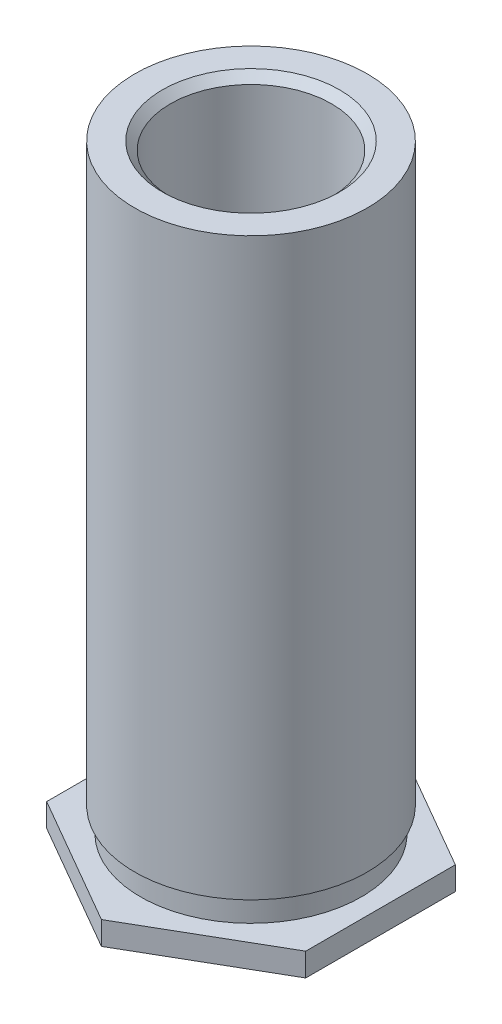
ISO-10303-21;
HEADER;
FILE_DESCRIPTION(('STEP AP214'),'2;1');
FILE_NAME('part.step','',(''),(''),'','','');
FILE_SCHEMA(('AUTOMOTIVE_DESIGN { 1 0 10303 214 1 1 1 1 }'));
ENDSEC;
DATA;
#1=APPLICATION_CONTEXT('core data for automotive mechanical design processes');
#2=APPLICATION_PROTOCOL_DEFINITION('international standard','automotive_design',2000,#1);
#3=PRODUCT_CONTEXT('',#1,'mechanical');
#4=PRODUCT('Part','Part','',(#3));
#5=PRODUCT_RELATED_PRODUCT_CATEGORY('part','',(#4));
#6=PRODUCT_DEFINITION_FORMATION('','',#4);
#7=PRODUCT_DEFINITION_CONTEXT('part definition',#1,'design');
#8=PRODUCT_DEFINITION('design','',#6,#7);
#9=PRODUCT_DEFINITION_SHAPE('','',#8);
#10=(LENGTH_UNIT() NAMED_UNIT(*) SI_UNIT(.MILLI.,.METRE.));
#11=(NAMED_UNIT(*) PLANE_ANGLE_UNIT() SI_UNIT($,.RADIAN.));
#12=(NAMED_UNIT(*) SI_UNIT($,.STERADIAN.) SOLID_ANGLE_UNIT());
#13=UNCERTAINTY_MEASURE_WITH_UNIT(LENGTH_MEASURE(1.E-05),#10,'distance_accuracy_value','');
#14=(GEOMETRIC_REPRESENTATION_CONTEXT(3) GLOBAL_UNCERTAINTY_ASSIGNED_CONTEXT((#13)) GLOBAL_UNIT_ASSIGNED_CONTEXT((#10,
#11,#12)) REPRESENTATION_CONTEXT('',''));
#15=CARTESIAN_POINT('',(0.,0.,0.));
#16=DIRECTION('',(0.,0.,1.));
#17=DIRECTION('',(1.,0.,0.));
#18=AXIS2_PLACEMENT_3D('',#15,#16,#17);
#19=CARTESIAN_POINT('',(4.596384,0.7112,0.));
#20=DIRECTION('',(0.,1.,0.));
#21=DIRECTION('',(0.,0.,1.));
#22=AXIS2_PLACEMENT_3D('',#19,#20,#21);
#23=PLANE('',#22);
#24=CARTESIAN_POINT('',(0.,0.711199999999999,0.));
#25=DIRECTION('',(0.,-1.,0.));
#26=DIRECTION('',(0.,0.,-1.));
#27=AXIS2_PLACEMENT_3D('',#24,#25,#26);
#28=CIRCLE('',#27,3.3782);
#29=CARTESIAN_POINT('',(0.,0.711199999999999,-3.3782));
#30=VERTEX_POINT('',#29);
#31=EDGE_CURVE('E143',#30,#30,#28,.T.);
#32=ORIENTED_EDGE('',*,*,#31,.T.);
#33=EDGE_LOOP('',(#32));
#34=FACE_BOUND('',#33,.T.);
#35=DIRECTION('',(0.866025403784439,0.,0.5));
#36=VECTOR('',#35,1.);
#37=CARTESIAN_POINT('',(0.,0.7112,4.57538541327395));
#38=LINE('',#37,#36);
#39=CARTESIAN_POINT('',(-3.9624,0.7112,2.28769270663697));
#40=VERTEX_POINT('',#39);
#41=CARTESIAN_POINT('',(0.,0.7112,4.57538541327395));
#42=VERTEX_POINT('',#41);
#43=EDGE_CURVE('E127',#40,#42,#38,.T.);
#44=ORIENTED_EDGE('',*,*,#43,.T.);
#45=DIRECTION('',(0.866025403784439,0.,-0.5));
#46=VECTOR('',#45,1.);
#47=CARTESIAN_POINT('',(3.9624,0.7112,2.28769270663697));
#48=LINE('',#47,#46);
#49=CARTESIAN_POINT('',(3.9624,0.7112,2.28769270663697));
#50=VERTEX_POINT('',#49);
#51=EDGE_CURVE('E116',#42,#50,#48,.T.);
#52=ORIENTED_EDGE('',*,*,#51,.T.);
#53=DIRECTION('',(0.,0.,-1.));
#54=VECTOR('',#53,1.);
#55=CARTESIAN_POINT('',(3.9624,0.7112,-2.28769270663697));
#56=LINE('',#55,#54);
#57=CARTESIAN_POINT('',(3.9624,0.7112,-2.28769270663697));
#58=VERTEX_POINT('',#57);
#59=EDGE_CURVE('E119',#50,#58,#56,.T.);
#60=ORIENTED_EDGE('',*,*,#59,.T.);
#61=DIRECTION('',(-0.866025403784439,0.,-0.5));
#62=VECTOR('',#61,1.);
#63=CARTESIAN_POINT('',(0.,0.7112,-4.57538541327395));
#64=LINE('',#63,#62);
#65=CARTESIAN_POINT('',(0.,0.7112,-4.57538541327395));
#66=VERTEX_POINT('',#65);
#67=EDGE_CURVE('E47',#58,#66,#64,.T.);
#68=ORIENTED_EDGE('',*,*,#67,.T.);
#69=DIRECTION('',(-0.866025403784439,0.,0.5));
#70=VECTOR('',#69,1.);
#71=CARTESIAN_POINT('',(-3.9624,0.7112,-2.28769270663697));
#72=LINE('',#71,#70);
#73=CARTESIAN_POINT('',(-3.9624,0.7112,-2.28769270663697));
#74=VERTEX_POINT('',#73);
#75=EDGE_CURVE('E92',#66,#74,#72,.T.);
#76=ORIENTED_EDGE('',*,*,#75,.T.);
#77=DIRECTION('',(0.,0.,1.));
#78=VECTOR('',#77,1.);
#79=CARTESIAN_POINT('',(-3.9624,0.7112,2.28769270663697));
#80=LINE('',#79,#78);
#81=EDGE_CURVE('E124',#74,#40,#80,.T.);
#82=ORIENTED_EDGE('',*,*,#81,.T.);
#83=EDGE_LOOP('',(#44,#52,#60,#68,#76,#82));
#84=FACE_BOUND('',#83,.T.);
#85=ADVANCED_FACE('F32',(#34,#84),#23,.T.);
#86=CARTESIAN_POINT('',(3.556,0.,0.));
#87=DIRECTION('',(0.,-1.,0.));
#88=DIRECTION('',(0.,0.,-1.));
#89=AXIS2_PLACEMENT_3D('',#86,#87,#88);
#90=PLANE('',#89);
#91=CARTESIAN_POINT('',(0.,0.,0.));
#92=DIRECTION('',(0.,-1.,0.));
#93=DIRECTION('',(0.,0.,-1.));
#94=AXIS2_PLACEMENT_3D('',#91,#92,#93);
#95=CIRCLE('',#94,3.556);
#96=CARTESIAN_POINT('',(0.,0.,-3.556));
#97=VERTEX_POINT('',#96);
#98=EDGE_CURVE('E140',#97,#97,#95,.T.);
#99=ORIENTED_EDGE('',*,*,#98,.F.);
#100=EDGE_LOOP('',(#99));
#101=FACE_BOUND('',#100,.T.);
#102=DIRECTION('',(0.,0.,-1.));
#103=VECTOR('',#102,1.);
#104=CARTESIAN_POINT('',(3.9624,0.,-2.28769270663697));
#105=LINE('',#104,#103);
#106=CARTESIAN_POINT('',(3.9624,0.,2.28769270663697));
#107=VERTEX_POINT('',#106);
#108=CARTESIAN_POINT('',(3.9624,0.,-2.28769270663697));
#109=VERTEX_POINT('',#108);
#110=EDGE_CURVE('E102',#107,#109,#105,.T.);
#111=ORIENTED_EDGE('',*,*,#110,.F.);
#112=DIRECTION('',(0.866025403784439,0.,-0.5));
#113=VECTOR('',#112,1.);
#114=CARTESIAN_POINT('',(3.9624,0.,2.28769270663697));
#115=LINE('',#114,#113);
#116=CARTESIAN_POINT('',(0.,0.,4.57538541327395));
#117=VERTEX_POINT('',#116);
#118=EDGE_CURVE('E55',#117,#107,#115,.T.);
#119=ORIENTED_EDGE('',*,*,#118,.F.);
#120=DIRECTION('',(0.866025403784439,0.,0.5));
#121=VECTOR('',#120,1.);
#122=CARTESIAN_POINT('',(0.,0.,4.57538541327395));
#123=LINE('',#122,#121);
#124=CARTESIAN_POINT('',(-3.9624,0.,2.28769270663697));
#125=VERTEX_POINT('',#124);
#126=EDGE_CURVE('E109',#125,#117,#123,.T.);
#127=ORIENTED_EDGE('',*,*,#126,.F.);
#128=DIRECTION('',(0.,0.,1.));
#129=VECTOR('',#128,1.);
#130=CARTESIAN_POINT('',(-3.9624,0.,2.28769270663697));
#131=LINE('',#130,#129);
#132=CARTESIAN_POINT('',(-3.9624,0.,-2.28769270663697));
#133=VERTEX_POINT('',#132);
#134=EDGE_CURVE('E107',#133,#125,#131,.T.);
#135=ORIENTED_EDGE('',*,*,#134,.F.);
#136=DIRECTION('',(-0.866025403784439,0.,0.5));
#137=VECTOR('',#136,1.);
#138=CARTESIAN_POINT('',(-3.9624,0.,-2.28769270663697));
#139=LINE('',#138,#137);
#140=CARTESIAN_POINT('',(0.,0.,-4.57538541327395));
#141=VERTEX_POINT('',#140);
#142=EDGE_CURVE('E89',#141,#133,#139,.T.);
#143=ORIENTED_EDGE('',*,*,#142,.F.);
#144=DIRECTION('',(-0.866025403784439,0.,-0.5));
#145=VECTOR('',#144,1.);
#146=CARTESIAN_POINT('',(0.,0.,-4.57538541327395));
#147=LINE('',#146,#145);
#148=EDGE_CURVE('E97',#109,#141,#147,.T.);
#149=ORIENTED_EDGE('',*,*,#148,.F.);
#150=EDGE_LOOP('',(#111,#119,#127,#135,#143,#149));
#151=FACE_BOUND('',#150,.T.);
#152=ADVANCED_FACE('F104',(#101,#151),#90,.T.);
#153=CARTESIAN_POINT('',(2.71018000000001,0.00507999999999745,0.));
#154=DIRECTION('',(0.,-1.,0.));
#155=DIRECTION('',(0.,0.,-1.));
#156=AXIS2_PLACEMENT_3D('',#153,#154,#155);
#157=PLANE('',#156);
#158=CARTESIAN_POINT('',(0.,0.00507999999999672,0.));
#159=DIRECTION('',(0.,-1.,0.));
#160=DIRECTION('',(0.,0.,-1.));
#161=AXIS2_PLACEMENT_3D('',#158,#159,#160);
#162=CIRCLE('',#161,3.556);
#163=CARTESIAN_POINT('',(0.,0.00507999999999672,-3.556));
#164=VERTEX_POINT('',#163);
#165=EDGE_CURVE('E132',#164,#164,#162,.T.);
#166=ORIENTED_EDGE('',*,*,#165,.T.);
#167=EDGE_LOOP('',(#166));
#168=FACE_BOUND('',#167,.T.);
#169=CARTESIAN_POINT('',(0.,0.00507999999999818,0.));
#170=DIRECTION('',(0.,-1.,0.));
#171=DIRECTION('',(0.,0.,-1.));
#172=AXIS2_PLACEMENT_3D('',#169,#170,#171);
#173=CIRCLE('',#172,2.71018000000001);
#174=CARTESIAN_POINT('',(0.,0.00507999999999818,-2.71018000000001));
#175=VERTEX_POINT('',#174);
#176=EDGE_CURVE('E11',#175,#175,#173,.T.);
#177=ORIENTED_EDGE('',*,*,#176,.F.);
#178=EDGE_LOOP('',(#177));
#179=FACE_BOUND('',#178,.T.);
#180=ADVANCED_FACE('F34',(#168,#179),#157,.T.);
#181=CARTESIAN_POINT('',(0.,0.251460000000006,0.));
#182=DIRECTION('',(0.,-1.,0.));
#183=DIRECTION('',(0.,0.,-1.));
#184=AXIS2_PLACEMENT_3D('',#181,#182,#183);
#185=CONICAL_SURFACE('',#184,2.4638,0.785398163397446);
#186=ORIENTED_EDGE('',*,*,#176,.T.);
#187=EDGE_LOOP('',(#186));
#188=FACE_BOUND('',#187,.T.);
#189=CARTESIAN_POINT('',(0.,0.251460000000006,0.));
#190=DIRECTION('',(0.,-1.,0.));
#191=DIRECTION('',(0.,0.,-1.));
#192=AXIS2_PLACEMENT_3D('',#189,#190,#191);
#193=CIRCLE('',#192,2.4638);
#194=CARTESIAN_POINT('',(0.,0.251460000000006,-2.4638));
#195=VERTEX_POINT('',#194);
#196=EDGE_CURVE('E40',#195,#195,#193,.T.);
#197=ORIENTED_EDGE('',*,*,#196,.F.);
#198=EDGE_LOOP('',(#197));
#199=FACE_BOUND('',#198,.T.);
#200=ADVANCED_FACE('F166',(#188,#199),#185,.F.);
#201=CARTESIAN_POINT('',(0.,0.,0.));
#202=DIRECTION('',(0.,-1.,0.));
#203=DIRECTION('',(0.,0.,-1.));
#204=AXIS2_PLACEMENT_3D('',#201,#202,#203);
#205=CYLINDRICAL_SURFACE('',#204,2.4638);
#206=ORIENTED_EDGE('',*,*,#196,.T.);
#207=EDGE_LOOP('',(#206));
#208=FACE_BOUND('',#207,.T.);
#209=CARTESIAN_POINT('',(0.,18.80362,0.));
#210=DIRECTION('',(0.,-1.,0.));
#211=DIRECTION('',(0.,0.,-1.));
#212=AXIS2_PLACEMENT_3D('',#209,#210,#211);
#213=CIRCLE('',#212,2.4638);
#214=CARTESIAN_POINT('',(0.,18.80362,-2.4638));
#215=VERTEX_POINT('',#214);
#216=EDGE_CURVE('E158',#215,#215,#213,.T.);
#217=ORIENTED_EDGE('',*,*,#216,.F.);
#218=EDGE_LOOP('',(#217));
#219=FACE_BOUND('',#218,.T.);
#220=ADVANCED_FACE('F163',(#208,#219),#205,.F.);
#221=CARTESIAN_POINT('',(0.,19.05,0.));
#222=DIRECTION('',(0.,1.,0.));
#223=DIRECTION('',(0.,0.,1.));
#224=AXIS2_PLACEMENT_3D('',#221,#222,#223);
#225=CONICAL_SURFACE('',#224,2.71018,0.785398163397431);
#226=ORIENTED_EDGE('',*,*,#216,.T.);
#227=EDGE_LOOP('',(#226));
#228=FACE_BOUND('',#227,.T.);
#229=CARTESIAN_POINT('',(0.,19.05,0.));
#230=DIRECTION('',(0.,-1.,0.));
#231=DIRECTION('',(0.,0.,-1.));
#232=AXIS2_PLACEMENT_3D('',#229,#230,#231);
#233=CIRCLE('',#232,2.71018);
#234=CARTESIAN_POINT('',(0.,19.05,-2.71018));
#235=VERTEX_POINT('',#234);
#236=EDGE_CURVE('E155',#235,#235,#233,.T.);
#237=ORIENTED_EDGE('',*,*,#236,.F.);
#238=EDGE_LOOP('',(#237));
#239=FACE_BOUND('',#238,.T.);
#240=ADVANCED_FACE('F173',(#228,#239),#225,.F.);
#241=CARTESIAN_POINT('',(3.556,19.05,0.));
#242=DIRECTION('',(0.,1.,0.));
#243=DIRECTION('',(0.,0.,1.));
#244=AXIS2_PLACEMENT_3D('',#241,#242,#243);
#245=PLANE('',#244);
#246=ORIENTED_EDGE('',*,*,#236,.T.);
#247=EDGE_LOOP('',(#246));
#248=FACE_BOUND('',#247,.T.);
#249=CARTESIAN_POINT('',(0.,19.05,0.));
#250=DIRECTION('',(0.,-1.,0.));
#251=DIRECTION('',(0.,0.,-1.));
#252=AXIS2_PLACEMENT_3D('',#249,#250,#251);
#253=CIRCLE('',#252,3.556);
#254=CARTESIAN_POINT('',(0.,19.05,-3.556));
#255=VERTEX_POINT('',#254);
#256=EDGE_CURVE('E152',#255,#255,#253,.T.);
#257=ORIENTED_EDGE('',*,*,#256,.F.);
#258=EDGE_LOOP('',(#257));
#259=FACE_BOUND('',#258,.T.);
#260=ADVANCED_FACE('F199',(#248,#259),#245,.T.);
#261=CARTESIAN_POINT('',(0.,0.,0.));
#262=DIRECTION('',(0.,-1.,0.));
#263=DIRECTION('',(0.,0.,-1.));
#264=AXIS2_PLACEMENT_3D('',#261,#262,#263);
#265=CYLINDRICAL_SURFACE('',#264,3.556);
#266=ORIENTED_EDGE('',*,*,#256,.T.);
#267=EDGE_LOOP('',(#266));
#268=FACE_BOUND('',#267,.T.);
#269=CARTESIAN_POINT('',(0.,1.45796,0.));
#270=DIRECTION('',(0.,-1.,0.));
#271=DIRECTION('',(0.,0.,-1.));
#272=AXIS2_PLACEMENT_3D('',#269,#270,#271);
#273=CIRCLE('',#272,3.556);
#274=CARTESIAN_POINT('',(0.,1.45796,-3.556));
#275=VERTEX_POINT('',#274);
#276=EDGE_CURVE('E149',#275,#275,#273,.T.);
#277=ORIENTED_EDGE('',*,*,#276,.F.);
#278=EDGE_LOOP('',(#277));
#279=FACE_BOUND('',#278,.T.);
#280=ADVANCED_FACE('F195',(#268,#279),#265,.T.);
#281=CARTESIAN_POINT('',(3.556,1.45796,0.));
#282=DIRECTION('',(0.,-1.,0.));
#283=DIRECTION('',(0.,0.,-1.));
#284=AXIS2_PLACEMENT_3D('',#281,#282,#283);
#285=PLANE('',#284);
#286=ORIENTED_EDGE('',*,*,#276,.T.);
#287=EDGE_LOOP('',(#286));
#288=FACE_BOUND('',#287,.T.);
#289=CARTESIAN_POINT('',(0.,1.45796,0.));
#290=DIRECTION('',(0.,-1.,0.));
#291=DIRECTION('',(0.,0.,-1.));
#292=AXIS2_PLACEMENT_3D('',#289,#290,#291);
#293=CIRCLE('',#292,3.3782);
#294=CARTESIAN_POINT('',(0.,1.45796,-3.3782));
#295=VERTEX_POINT('',#294);
#296=EDGE_CURVE('E146',#295,#295,#293,.T.);
#297=ORIENTED_EDGE('',*,*,#296,.F.);
#298=EDGE_LOOP('',(#297));
#299=FACE_BOUND('',#298,.T.);
#300=ADVANCED_FACE('F191',(#288,#299),#285,.T.);
#301=CARTESIAN_POINT('',(0.,0.,0.));
#302=DIRECTION('',(0.,-1.,0.));
#303=DIRECTION('',(0.,0.,-1.));
#304=AXIS2_PLACEMENT_3D('',#301,#302,#303);
#305=CYLINDRICAL_SURFACE('',#304,3.3782);
#306=ORIENTED_EDGE('',*,*,#296,.T.);
#307=EDGE_LOOP('',(#306));
#308=FACE_BOUND('',#307,.T.);
#309=ORIENTED_EDGE('',*,*,#31,.F.);
#310=EDGE_LOOP('',(#309));
#311=FACE_BOUND('',#310,.T.);
#312=ADVANCED_FACE('F187',(#308,#311),#305,.T.);
#313=CARTESIAN_POINT('',(0.,0.,0.));
#314=DIRECTION('',(0.,-1.,0.));
#315=DIRECTION('',(0.,0.,-1.));
#316=AXIS2_PLACEMENT_3D('',#313,#314,#315);
#317=CYLINDRICAL_SURFACE('',#316,3.556);
#318=ORIENTED_EDGE('',*,*,#98,.T.);
#319=EDGE_LOOP('',(#318));
#320=FACE_BOUND('',#319,.T.);
#321=ORIENTED_EDGE('',*,*,#165,.F.);
#322=EDGE_LOOP('',(#321));
#323=FACE_BOUND('',#322,.T.);
#324=ADVANCED_FACE('F190',(#320,#323),#317,.F.);
#325=CARTESIAN_POINT('',(3.9624,0.,2.28769270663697));
#326=DIRECTION('',(0.5,0.,0.866025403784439));
#327=DIRECTION('',(0.866025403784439,0.,-0.5));
#328=AXIS2_PLACEMENT_3D('',#325,#326,#327);
#329=PLANE('',#328);
#330=ORIENTED_EDGE('',*,*,#51,.F.);
#331=DIRECTION('',(0.,1.,0.));
#332=VECTOR('',#331,1.);
#333=CARTESIAN_POINT('',(0.,0.,4.57538541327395));
#334=LINE('',#333,#332);
#335=EDGE_CURVE('E130',#117,#42,#334,.T.);
#336=ORIENTED_EDGE('',*,*,#335,.F.);
#337=ORIENTED_EDGE('',*,*,#118,.T.);
#338=DIRECTION('',(0.,1.,0.));
#339=VECTOR('',#338,1.);
#340=CARTESIAN_POINT('',(3.9624,0.,2.28769270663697));
#341=LINE('',#340,#339);
#342=EDGE_CURVE('E115',#107,#50,#341,.T.);
#343=ORIENTED_EDGE('',*,*,#342,.T.);
#344=EDGE_LOOP('',(#330,#336,#337,#343));
#345=FACE_BOUND('',#344,.T.);
#346=ADVANCED_FACE('F243',(#345),#329,.T.);
#347=CARTESIAN_POINT('',(0.,0.,4.57538541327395));
#348=DIRECTION('',(-0.5,0.,0.866025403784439));
#349=DIRECTION('',(0.866025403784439,0.,0.5));
#350=AXIS2_PLACEMENT_3D('',#347,#348,#349);
#351=PLANE('',#350);
#352=ORIENTED_EDGE('',*,*,#43,.F.);
#353=DIRECTION('',(0.,1.,0.));
#354=VECTOR('',#353,1.);
#355=CARTESIAN_POINT('',(-3.9624,0.,2.28769270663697));
#356=LINE('',#355,#354);
#357=EDGE_CURVE('E133',#125,#40,#356,.T.);
#358=ORIENTED_EDGE('',*,*,#357,.F.);
#359=ORIENTED_EDGE('',*,*,#126,.T.);
#360=ORIENTED_EDGE('',*,*,#335,.T.);
#361=EDGE_LOOP('',(#352,#358,#359,#360));
#362=FACE_BOUND('',#361,.T.);
#363=ADVANCED_FACE('F250',(#362),#351,.T.);
#364=CARTESIAN_POINT('',(-3.9624,0.,2.28769270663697));
#365=DIRECTION('',(-1.,0.,0.));
#366=DIRECTION('',(0.,0.,1.));
#367=AXIS2_PLACEMENT_3D('',#364,#365,#366);
#368=PLANE('',#367);
#369=ORIENTED_EDGE('',*,*,#81,.F.);
#370=DIRECTION('',(0.,1.,0.));
#371=VECTOR('',#370,1.);
#372=CARTESIAN_POINT('',(-3.9624,0.,-2.28769270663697));
#373=LINE('',#372,#371);
#374=EDGE_CURVE('E93',#133,#74,#373,.T.);
#375=ORIENTED_EDGE('',*,*,#374,.F.);
#376=ORIENTED_EDGE('',*,*,#134,.T.);
#377=ORIENTED_EDGE('',*,*,#357,.T.);
#378=EDGE_LOOP('',(#369,#375,#376,#377));
#379=FACE_BOUND('',#378,.T.);
#380=ADVANCED_FACE('F258',(#379),#368,.T.);
#381=CARTESIAN_POINT('',(-3.9624,0.,-2.28769270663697));
#382=DIRECTION('',(-0.5,0.,-0.866025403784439));
#383=DIRECTION('',(-0.866025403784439,0.,0.5));
#384=AXIS2_PLACEMENT_3D('',#381,#382,#383);
#385=PLANE('',#384);
#386=ORIENTED_EDGE('',*,*,#75,.F.);
#387=DIRECTION('',(0.,1.,0.));
#388=VECTOR('',#387,1.);
#389=CARTESIAN_POINT('',(0.,0.,-4.57538541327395));
#390=LINE('',#389,#388);
#391=EDGE_CURVE('E85',#141,#66,#390,.T.);
#392=ORIENTED_EDGE('',*,*,#391,.F.);
#393=ORIENTED_EDGE('',*,*,#142,.T.);
#394=ORIENTED_EDGE('',*,*,#374,.T.);
#395=EDGE_LOOP('',(#386,#392,#393,#394));
#396=FACE_BOUND('',#395,.T.);
#397=ADVANCED_FACE('F87',(#396),#385,.T.);
#398=CARTESIAN_POINT('',(0.,0.,-4.57538541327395));
#399=DIRECTION('',(0.5,0.,-0.866025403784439));
#400=DIRECTION('',(-0.866025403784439,0.,-0.5));
#401=AXIS2_PLACEMENT_3D('',#398,#399,#400);
#402=PLANE('',#401);
#403=ORIENTED_EDGE('',*,*,#67,.F.);
#404=DIRECTION('',(0.,1.,0.));
#405=VECTOR('',#404,1.);
#406=CARTESIAN_POINT('',(3.9624,0.,-2.28769270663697));
#407=LINE('',#406,#405);
#408=EDGE_CURVE('E94',#109,#58,#407,.T.);
#409=ORIENTED_EDGE('',*,*,#408,.F.);
#410=ORIENTED_EDGE('',*,*,#148,.T.);
#411=ORIENTED_EDGE('',*,*,#391,.T.);
#412=EDGE_LOOP('',(#403,#409,#410,#411));
#413=FACE_BOUND('',#412,.T.);
#414=ADVANCED_FACE('F98',(#413),#402,.T.);
#415=CARTESIAN_POINT('',(3.9624,0.,-2.28769270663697));
#416=DIRECTION('',(1.,0.,0.));
#417=DIRECTION('',(0.,0.,-1.));
#418=AXIS2_PLACEMENT_3D('',#415,#416,#417);
#419=PLANE('',#418);
#420=ORIENTED_EDGE('',*,*,#59,.F.);
#421=ORIENTED_EDGE('',*,*,#342,.F.);
#422=ORIENTED_EDGE('',*,*,#110,.T.);
#423=ORIENTED_EDGE('',*,*,#408,.T.);
#424=EDGE_LOOP('',(#420,#421,#422,#423));
#425=FACE_BOUND('',#424,.T.);
#426=ADVANCED_FACE('F279',(#425),#419,.T.);
#427=CLOSED_SHELL('',(#85,#152,#180,#200,#220,#240,#260,#280,#300,#312,#324,#346,#363,#380,#397,
#414,#426));
#428=MANIFOLD_SOLID_BREP('B2',#427);
#429=ADVANCED_BREP_SHAPE_REPRESENTATION('',(#18,#428),#14);
#430=SHAPE_DEFINITION_REPRESENTATION(#9,#429);
ENDSEC;
END-ISO-10303-21;
